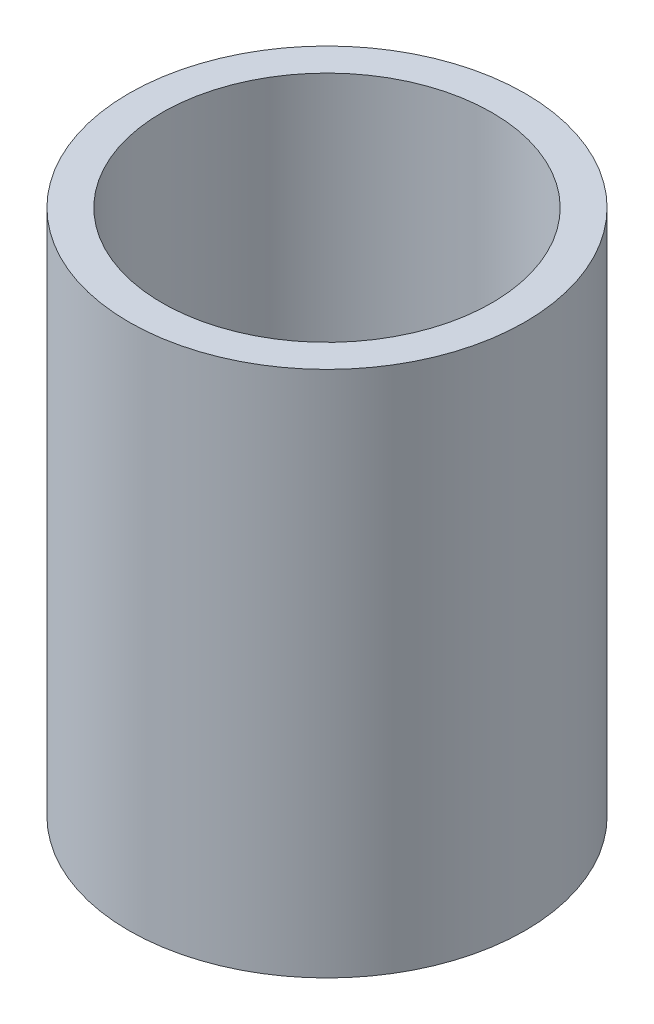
ISO-10303-21;
HEADER;
FILE_DESCRIPTION(('STEP AP214'),'2;1');
FILE_NAME('part.step','',(''),(''),'','','');
FILE_SCHEMA(('AUTOMOTIVE_DESIGN { 1 0 10303 214 1 1 1 1 }'));
ENDSEC;
DATA;
#1=APPLICATION_CONTEXT('core data for automotive mechanical design processes');
#2=APPLICATION_PROTOCOL_DEFINITION('international standard','automotive_design',2000,#1);
#3=PRODUCT_CONTEXT('',#1,'mechanical');
#4=PRODUCT('Part','Part','',(#3));
#5=PRODUCT_RELATED_PRODUCT_CATEGORY('part','',(#4));
#6=PRODUCT_DEFINITION_FORMATION('','',#4);
#7=PRODUCT_DEFINITION_CONTEXT('part definition',#1,'design');
#8=PRODUCT_DEFINITION('design','',#6,#7);
#9=PRODUCT_DEFINITION_SHAPE('','',#8);
#10=(LENGTH_UNIT() NAMED_UNIT(*) SI_UNIT(.MILLI.,.METRE.));
#11=(NAMED_UNIT(*) PLANE_ANGLE_UNIT() SI_UNIT($,.RADIAN.));
#12=(NAMED_UNIT(*) SI_UNIT($,.STERADIAN.) SOLID_ANGLE_UNIT());
#13=UNCERTAINTY_MEASURE_WITH_UNIT(LENGTH_MEASURE(1.E-05),#10,'distance_accuracy_value','');
#14=(GEOMETRIC_REPRESENTATION_CONTEXT(3) GLOBAL_UNCERTAINTY_ASSIGNED_CONTEXT((#13)) GLOBAL_UNIT_ASSIGNED_CONTEXT((#10,
#11,#12)) REPRESENTATION_CONTEXT('',''));
#15=CARTESIAN_POINT('',(0.,0.,0.));
#16=DIRECTION('',(0.,0.,1.));
#17=DIRECTION('',(1.,0.,0.));
#18=AXIS2_PLACEMENT_3D('',#15,#16,#17);
#19=CARTESIAN_POINT('',(0.,3.18,0.));
#20=DIRECTION('',(0.,1.,0.));
#21=DIRECTION('',(0.,0.,1.));
#22=AXIS2_PLACEMENT_3D('',#19,#20,#21);
#23=PLANE('',#22);
#24=CARTESIAN_POINT('',(0.,3.18,0.));
#25=DIRECTION('',(0.,1.,0.));
#26=DIRECTION('',(0.,0.,1.));
#27=AXIS2_PLACEMENT_3D('',#24,#25,#26);
#28=CIRCLE('',#27,1.195);
#29=CARTESIAN_POINT('',(0.,3.18,-1.195));
#30=VERTEX_POINT('',#29);
#31=EDGE_CURVE('E10',#30,#30,#28,.T.);
#32=ORIENTED_EDGE('',*,*,#31,.T.);
#33=EDGE_LOOP('',(#32));
#34=FACE_BOUND('',#33,.T.);
#35=CARTESIAN_POINT('',(0.,3.18,0.));
#36=DIRECTION('',(0.,1.,0.));
#37=DIRECTION('',(0.,0.,1.));
#38=AXIS2_PLACEMENT_3D('',#35,#36,#37);
#39=CIRCLE('',#38,0.995);
#40=CARTESIAN_POINT('',(0.,3.18,-0.995));
#41=VERTEX_POINT('',#40);
#42=EDGE_CURVE('E43',#41,#41,#39,.T.);
#43=ORIENTED_EDGE('',*,*,#42,.F.);
#44=EDGE_LOOP('',(#43));
#45=FACE_BOUND('',#44,.T.);
#46=ADVANCED_FACE('F32',(#34,#45),#23,.T.);
#47=CARTESIAN_POINT('',(0.,0.,0.));
#48=DIRECTION('',(0.,1.,0.));
#49=DIRECTION('',(0.,0.,1.));
#50=AXIS2_PLACEMENT_3D('',#47,#48,#49);
#51=PLANE('',#50);
#52=CARTESIAN_POINT('',(0.,0.,0.));
#53=DIRECTION('',(0.,1.,0.));
#54=DIRECTION('',(0.,0.,1.));
#55=AXIS2_PLACEMENT_3D('',#52,#53,#54);
#56=CIRCLE('',#55,1.195);
#57=CARTESIAN_POINT('',(0.,0.,-1.195));
#58=VERTEX_POINT('',#57);
#59=EDGE_CURVE('E36',#58,#58,#56,.T.);
#60=ORIENTED_EDGE('',*,*,#59,.F.);
#61=EDGE_LOOP('',(#60));
#62=FACE_BOUND('',#61,.T.);
#63=CARTESIAN_POINT('',(0.,0.,0.));
#64=DIRECTION('',(0.,1.,0.));
#65=DIRECTION('',(0.,0.,1.));
#66=AXIS2_PLACEMENT_3D('',#63,#64,#65);
#67=CIRCLE('',#66,0.995);
#68=CARTESIAN_POINT('',(0.,0.,-0.995));
#69=VERTEX_POINT('',#68);
#70=EDGE_CURVE('E45',#69,#69,#67,.T.);
#71=ORIENTED_EDGE('',*,*,#70,.T.);
#72=EDGE_LOOP('',(#71));
#73=FACE_BOUND('',#72,.T.);
#74=ADVANCED_FACE('F55',(#62,#73),#51,.F.);
#75=CARTESIAN_POINT('',(0.,3.18,0.));
#76=DIRECTION('',(0.,-1.,0.));
#77=DIRECTION('',(0.,0.,-1.));
#78=AXIS2_PLACEMENT_3D('',#75,#76,#77);
#79=CYLINDRICAL_SURFACE('',#78,1.195);
#80=CARTESIAN_POINT('',(0.,3.18,-1.195));
#81=CARTESIAN_POINT('',(0.,3.146875,-1.195));
#82=CARTESIAN_POINT('',(0.,3.11375,-1.195));
#83=CARTESIAN_POINT('',(0.,3.0475,-1.195));
#84=CARTESIAN_POINT('',(0.,3.014375,-1.195));
#85=CARTESIAN_POINT('',(0.,2.948125,-1.195));
#86=CARTESIAN_POINT('',(0.,2.915,-1.195));
#87=CARTESIAN_POINT('',(0.,2.84875,-1.195));
#88=CARTESIAN_POINT('',(0.,2.815625,-1.195));
#89=CARTESIAN_POINT('',(0.,2.749375,-1.195));
#90=CARTESIAN_POINT('',(0.,2.71625,-1.195));
#91=CARTESIAN_POINT('',(0.,2.65,-1.195));
#92=CARTESIAN_POINT('',(0.,2.616875,-1.195));
#93=CARTESIAN_POINT('',(0.,2.550625,-1.195));
#94=CARTESIAN_POINT('',(0.,2.5175,-1.195));
#95=CARTESIAN_POINT('',(0.,2.45125,-1.195));
#96=CARTESIAN_POINT('',(0.,2.418125,-1.195));
#97=CARTESIAN_POINT('',(0.,2.351875,-1.195));
#98=CARTESIAN_POINT('',(0.,2.31875,-1.195));
#99=CARTESIAN_POINT('',(0.,2.2525,-1.195));
#100=CARTESIAN_POINT('',(0.,2.219375,-1.195));
#101=CARTESIAN_POINT('',(0.,2.153125,-1.195));
#102=CARTESIAN_POINT('',(0.,2.12,-1.195));
#103=CARTESIAN_POINT('',(0.,2.05375,-1.195));
#104=CARTESIAN_POINT('',(0.,2.020625,-1.195));
#105=CARTESIAN_POINT('',(0.,1.954375,-1.195));
#106=CARTESIAN_POINT('',(0.,1.92125,-1.195));
#107=CARTESIAN_POINT('',(0.,1.855,-1.195));
#108=CARTESIAN_POINT('',(0.,1.821875,-1.195));
#109=CARTESIAN_POINT('',(0.,1.755625,-1.195));
#110=CARTESIAN_POINT('',(0.,1.7225,-1.195));
#111=CARTESIAN_POINT('',(0.,1.65625,-1.195));
#112=CARTESIAN_POINT('',(0.,1.623125,-1.195));
#113=CARTESIAN_POINT('',(0.,1.556875,-1.195));
#114=CARTESIAN_POINT('',(0.,1.52375,-1.195));
#115=CARTESIAN_POINT('',(0.,1.4575,-1.195));
#116=CARTESIAN_POINT('',(0.,1.424375,-1.195));
#117=CARTESIAN_POINT('',(0.,1.358125,-1.195));
#118=CARTESIAN_POINT('',(0.,1.325,-1.195));
#119=CARTESIAN_POINT('',(0.,1.25875,-1.195));
#120=CARTESIAN_POINT('',(0.,1.225625,-1.195));
#121=CARTESIAN_POINT('',(0.,1.159375,-1.195));
#122=CARTESIAN_POINT('',(0.,1.12625,-1.195));
#123=CARTESIAN_POINT('',(0.,1.06,-1.195));
#124=CARTESIAN_POINT('',(0.,1.026875,-1.195));
#125=CARTESIAN_POINT('',(0.,0.960625,-1.195));
#126=CARTESIAN_POINT('',(0.,0.9275,-1.195));
#127=CARTESIAN_POINT('',(0.,0.86125,-1.195));
#128=CARTESIAN_POINT('',(0.,0.828125,-1.195));
#129=CARTESIAN_POINT('',(0.,0.761875,-1.195));
#130=CARTESIAN_POINT('',(0.,0.72875,-1.195));
#131=CARTESIAN_POINT('',(0.,0.6625,-1.195));
#132=CARTESIAN_POINT('',(0.,0.629375,-1.195));
#133=CARTESIAN_POINT('',(0.,0.563125,-1.195));
#134=CARTESIAN_POINT('',(0.,0.53,-1.195));
#135=CARTESIAN_POINT('',(0.,0.46375,-1.195));
#136=CARTESIAN_POINT('',(0.,0.430625,-1.195));
#137=CARTESIAN_POINT('',(0.,0.364375,-1.195));
#138=CARTESIAN_POINT('',(0.,0.33125,-1.195));
#139=CARTESIAN_POINT('',(0.,0.265,-1.195));
#140=CARTESIAN_POINT('',(0.,0.231875,-1.195));
#141=CARTESIAN_POINT('',(0.,0.165625,-1.195));
#142=CARTESIAN_POINT('',(0.,0.1325,-1.195));
#143=CARTESIAN_POINT('',(0.,0.06625,-1.195));
#144=CARTESIAN_POINT('',(0.,0.033125,-1.195));
#145=CARTESIAN_POINT('',(0.,0.,-1.195));
#146=B_SPLINE_CURVE_WITH_KNOTS('',3,(#80,#81,#82,#83,#84,#85,#86,#87,#88,#89,#90,#91,#92,#93,
#94,#95,#96,#97,#98,#99,#100,#101,#102,#103,#104,#105,#106,#107,#108,#109,#110,#111,#112,#113,
#114,#115,#116,#117,#118,#119,#120,#121,#122,#123,#124,#125,#126,#127,#128,#129,#130,#131,#132,
#133,#134,#135,#136,#137,#138,#139,#140,#141,#142,#143,#144,#145),.UNSPECIFIED.,.F.,.F.,(4,2,2,
2,2,2,2,2,2,2,2,2,2,2,2,2,2,2,2,2,2,2,2,2,2,2,2,2,2,2,2,2,4),(0.,0.0993749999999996,0.19875,
0.298125,0.3975,0.496875,0.59625,0.695625,0.795,0.894375,0.99375,1.093125,1.1925,1.291875,
1.39125,1.490625,1.59,1.689375,1.78875,1.888125,1.9875,2.086875,2.18625,2.285625,2.385,2.484375,
2.58375,2.683125,2.7825,2.881875,2.98125,3.080625,3.18),.UNSPECIFIED.);
#147=EDGE_CURVE('BSEAM34',#30,#58,#146,.T.);
#148=ORIENTED_EDGE('',*,*,#31,.F.);
#149=ORIENTED_EDGE('',*,*,#59,.T.);
#150=ORIENTED_EDGE('',*,*,#147,.T.);
#151=ORIENTED_EDGE('',*,*,#147,.F.);
#152=EDGE_LOOP('',(#148,#150,#149,#151));
#153=FACE_BOUND('',#152,.T.);
#154=ADVANCED_FACE('F34',(#153),#79,.T.);
#155=CARTESIAN_POINT('',(0.,3.18,0.));
#156=DIRECTION('',(0.,-1.,0.));
#157=DIRECTION('',(0.,0.,-1.));
#158=AXIS2_PLACEMENT_3D('',#155,#156,#157);
#159=CYLINDRICAL_SURFACE('',#158,0.995);
#160=CARTESIAN_POINT('',(0.,3.18,-0.995));
#161=CARTESIAN_POINT('',(0.,3.146875,-0.995));
#162=CARTESIAN_POINT('',(0.,3.11375,-0.995));
#163=CARTESIAN_POINT('',(0.,3.0475,-0.995));
#164=CARTESIAN_POINT('',(0.,3.014375,-0.995));
#165=CARTESIAN_POINT('',(0.,2.948125,-0.995));
#166=CARTESIAN_POINT('',(0.,2.915,-0.995));
#167=CARTESIAN_POINT('',(0.,2.84875,-0.995));
#168=CARTESIAN_POINT('',(0.,2.815625,-0.995));
#169=CARTESIAN_POINT('',(0.,2.749375,-0.995));
#170=CARTESIAN_POINT('',(0.,2.71625,-0.995));
#171=CARTESIAN_POINT('',(0.,2.65,-0.995));
#172=CARTESIAN_POINT('',(0.,2.616875,-0.995));
#173=CARTESIAN_POINT('',(0.,2.550625,-0.995));
#174=CARTESIAN_POINT('',(0.,2.5175,-0.995));
#175=CARTESIAN_POINT('',(0.,2.45125,-0.995));
#176=CARTESIAN_POINT('',(0.,2.418125,-0.995));
#177=CARTESIAN_POINT('',(0.,2.351875,-0.995));
#178=CARTESIAN_POINT('',(0.,2.31875,-0.995));
#179=CARTESIAN_POINT('',(0.,2.2525,-0.995));
#180=CARTESIAN_POINT('',(0.,2.219375,-0.995));
#181=CARTESIAN_POINT('',(0.,2.153125,-0.995));
#182=CARTESIAN_POINT('',(0.,2.12,-0.995));
#183=CARTESIAN_POINT('',(0.,2.05375,-0.995));
#184=CARTESIAN_POINT('',(0.,2.020625,-0.995));
#185=CARTESIAN_POINT('',(0.,1.954375,-0.995));
#186=CARTESIAN_POINT('',(0.,1.92125,-0.995));
#187=CARTESIAN_POINT('',(0.,1.855,-0.995));
#188=CARTESIAN_POINT('',(0.,1.821875,-0.995));
#189=CARTESIAN_POINT('',(0.,1.755625,-0.995));
#190=CARTESIAN_POINT('',(0.,1.7225,-0.995));
#191=CARTESIAN_POINT('',(0.,1.65625,-0.995));
#192=CARTESIAN_POINT('',(0.,1.623125,-0.995));
#193=CARTESIAN_POINT('',(0.,1.556875,-0.995));
#194=CARTESIAN_POINT('',(0.,1.52375,-0.995));
#195=CARTESIAN_POINT('',(0.,1.4575,-0.995));
#196=CARTESIAN_POINT('',(0.,1.424375,-0.995));
#197=CARTESIAN_POINT('',(0.,1.358125,-0.995));
#198=CARTESIAN_POINT('',(0.,1.325,-0.995));
#199=CARTESIAN_POINT('',(0.,1.25875,-0.995));
#200=CARTESIAN_POINT('',(0.,1.225625,-0.995));
#201=CARTESIAN_POINT('',(0.,1.159375,-0.995));
#202=CARTESIAN_POINT('',(0.,1.12625,-0.995));
#203=CARTESIAN_POINT('',(0.,1.06,-0.995));
#204=CARTESIAN_POINT('',(0.,1.026875,-0.995));
#205=CARTESIAN_POINT('',(0.,0.960625,-0.995));
#206=CARTESIAN_POINT('',(0.,0.9275,-0.995));
#207=CARTESIAN_POINT('',(0.,0.86125,-0.995));
#208=CARTESIAN_POINT('',(0.,0.828125,-0.995));
#209=CARTESIAN_POINT('',(0.,0.761875,-0.995));
#210=CARTESIAN_POINT('',(0.,0.72875,-0.995));
#211=CARTESIAN_POINT('',(0.,0.6625,-0.995));
#212=CARTESIAN_POINT('',(0.,0.629375,-0.995));
#213=CARTESIAN_POINT('',(0.,0.563125,-0.995));
#214=CARTESIAN_POINT('',(0.,0.53,-0.995));
#215=CARTESIAN_POINT('',(0.,0.46375,-0.995));
#216=CARTESIAN_POINT('',(0.,0.430625,-0.995));
#217=CARTESIAN_POINT('',(0.,0.364375,-0.995));
#218=CARTESIAN_POINT('',(0.,0.33125,-0.995));
#219=CARTESIAN_POINT('',(0.,0.265,-0.995));
#220=CARTESIAN_POINT('',(0.,0.231875,-0.995));
#221=CARTESIAN_POINT('',(0.,0.165625,-0.995));
#222=CARTESIAN_POINT('',(0.,0.1325,-0.995));
#223=CARTESIAN_POINT('',(0.,0.06625,-0.995));
#224=CARTESIAN_POINT('',(0.,0.033125,-0.995));
#225=CARTESIAN_POINT('',(0.,0.,-0.995));
#226=B_SPLINE_CURVE_WITH_KNOTS('',3,(#160,#161,#162,#163,#164,#165,#166,#167,#168,#169,#170,
#171,#172,#173,#174,#175,#176,#177,#178,#179,#180,#181,#182,#183,#184,#185,#186,#187,#188,#189,
#190,#191,#192,#193,#194,#195,#196,#197,#198,#199,#200,#201,#202,#203,#204,#205,#206,#207,#208,
#209,#210,#211,#212,#213,#214,#215,#216,#217,#218,#219,#220,#221,#222,#223,#224,#225),
.UNSPECIFIED.,.F.,.F.,(4,2,2,2,2,2,2,2,2,2,2,2,2,2,2,2,2,2,2,2,2,2,2,2,2,2,2,2,2,2,2,2,4),(0.,
0.0993749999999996,0.19875,0.298125,0.3975,0.496875,0.59625,0.695625,0.795,0.894375,0.99375,
1.093125,1.1925,1.291875,1.39125,1.490625,1.59,1.689375,1.78875,1.888125,1.9875,2.086875,
2.18625,2.285625,2.385,2.484375,2.58375,2.683125,2.7825,2.881875,2.98125,3.080625,3.18),.UNSPECIFIED.);
#227=EDGE_CURVE('BSEAM51',#41,#69,#226,.T.);
#228=ORIENTED_EDGE('',*,*,#42,.T.);
#229=ORIENTED_EDGE('',*,*,#70,.F.);
#230=ORIENTED_EDGE('',*,*,#227,.T.);
#231=ORIENTED_EDGE('',*,*,#227,.F.);
#232=EDGE_LOOP('',(#228,#230,#229,#231));
#233=FACE_BOUND('',#232,.T.);
#234=ADVANCED_FACE('F51',(#233),#159,.F.);
#235=CLOSED_SHELL('',(#46,#74,#154,#234));
#236=MANIFOLD_SOLID_BREP('B2',#235);
#237=ADVANCED_BREP_SHAPE_REPRESENTATION('',(#18,#236),#14);
#238=SHAPE_DEFINITION_REPRESENTATION(#9,#237);
ENDSEC;
END-ISO-10303-21;
